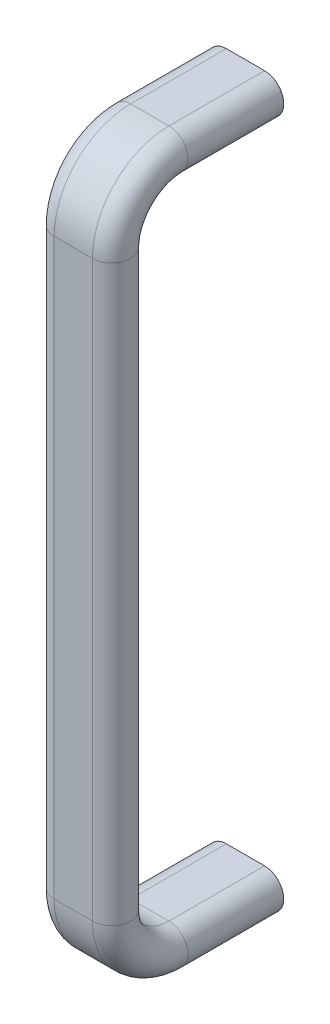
ISO-10303-21;
HEADER;
FILE_DESCRIPTION(('STEP AP214'),'2;1');
FILE_NAME('part.step','',(''),(''),'','','');
FILE_SCHEMA(('AUTOMOTIVE_DESIGN { 1 0 10303 214 1 1 1 1 }'));
ENDSEC;
DATA;
#1=APPLICATION_CONTEXT('core data for automotive mechanical design processes');
#2=APPLICATION_PROTOCOL_DEFINITION('international standard','automotive_design',2000,#1);
#3=PRODUCT_CONTEXT('',#1,'mechanical');
#4=PRODUCT('Part','Part','',(#3));
#5=PRODUCT_RELATED_PRODUCT_CATEGORY('part','',(#4));
#6=PRODUCT_DEFINITION_FORMATION('','',#4);
#7=PRODUCT_DEFINITION_CONTEXT('part definition',#1,'design');
#8=PRODUCT_DEFINITION('design','',#6,#7);
#9=PRODUCT_DEFINITION_SHAPE('','',#8);
#10=(LENGTH_UNIT() NAMED_UNIT(*) SI_UNIT(.MILLI.,.METRE.));
#11=(NAMED_UNIT(*) PLANE_ANGLE_UNIT() SI_UNIT($,.RADIAN.));
#12=(NAMED_UNIT(*) SI_UNIT($,.STERADIAN.) SOLID_ANGLE_UNIT());
#13=UNCERTAINTY_MEASURE_WITH_UNIT(LENGTH_MEASURE(1.E-05),#10,'distance_accuracy_value','');
#14=(GEOMETRIC_REPRESENTATION_CONTEXT(3) GLOBAL_UNCERTAINTY_ASSIGNED_CONTEXT((#13)) GLOBAL_UNIT_ASSIGNED_CONTEXT((#10,
#11,#12)) REPRESENTATION_CONTEXT('',''));
#15=CARTESIAN_POINT('',(0.,0.,0.));
#16=DIRECTION('',(0.,0.,1.));
#17=DIRECTION('',(1.,0.,0.));
#18=AXIS2_PLACEMENT_3D('',#15,#16,#17);
#19=CARTESIAN_POINT('',(213.429589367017,449.678380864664,9.99999999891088));
#20=DIRECTION('',(0.,0.,-1.));
#21=DIRECTION('',(-1.,0.,0.));
#22=AXIS2_PLACEMENT_3D('',#19,#20,#21);
#23=CONICAL_SURFACE('',#22,2.06699999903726,1.02974425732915);
#24=CARTESIAN_POINT('',(213.429589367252,449.678380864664,11.2419789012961));
#25=VERTEX_POINT('',#24);
#26=VERTEX_LOOP('',#25);
#27=FACE_BOUND('',#26,.T.);
#28=CARTESIAN_POINT('',(213.429589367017,449.678380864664,9.99999999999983));
#29=DIRECTION('',(0.,0.,-1.));
#30=DIRECTION('',(-1.,0.,0.));
#31=AXIS2_PLACEMENT_3D('',#28,#29,#30);
#32=CIRCLE('',#31,2.067);
#33=CARTESIAN_POINT('',(211.362589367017,449.678380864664,9.99999999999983));
#34=VERTEX_POINT('',#33);
#35=EDGE_CURVE('E210',#34,#34,#32,.T.);
#36=ORIENTED_EDGE('',*,*,#35,.T.);
#37=EDGE_LOOP('',(#36));
#38=FACE_BOUND('',#37,.T.);
#39=ADVANCED_FACE('F16',(#27,#38),#23,.F.);
#40=CARTESIAN_POINT('',(213.429589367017,269.678380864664,9.99999999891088));
#41=DIRECTION('',(0.,0.,-1.));
#42=DIRECTION('',(-1.,0.,0.));
#43=AXIS2_PLACEMENT_3D('',#40,#41,#42);
#44=CONICAL_SURFACE('',#43,2.06699999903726,1.02974425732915);
#45=CARTESIAN_POINT('',(213.429589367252,269.678380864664,11.2419789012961));
#46=VERTEX_POINT('',#45);
#47=VERTEX_LOOP('',#46);
#48=FACE_BOUND('',#47,.T.);
#49=CARTESIAN_POINT('',(213.429589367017,269.678380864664,9.99999999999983));
#50=DIRECTION('',(0.,0.,-1.));
#51=DIRECTION('',(-1.,0.,0.));
#52=AXIS2_PLACEMENT_3D('',#49,#50,#51);
#53=CIRCLE('',#52,2.067);
#54=CARTESIAN_POINT('',(211.362589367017,269.678380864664,9.99999999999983));
#55=VERTEX_POINT('',#54);
#56=EDGE_CURVE('E131',#55,#55,#53,.T.);
#57=ORIENTED_EDGE('',*,*,#56,.T.);
#58=EDGE_LOOP('',(#57));
#59=FACE_BOUND('',#58,.T.);
#60=ADVANCED_FACE('F398',(#48,#59),#44,.F.);
#61=CARTESIAN_POINT('',(213.429589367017,449.678380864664,2.49999999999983));
#62=DIRECTION('',(0.,0.,-1.));
#63=DIRECTION('',(-1.,0.,0.));
#64=AXIS2_PLACEMENT_3D('',#61,#62,#63);
#65=CYLINDRICAL_SURFACE('',#64,2.067);
#66=ORIENTED_EDGE('',*,*,#35,.F.);
#67=EDGE_LOOP('',(#66));
#68=FACE_BOUND('',#67,.T.);
#69=CARTESIAN_POINT('',(213.429589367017,449.678380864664,-5.00000000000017));
#70=DIRECTION('',(0.,0.,-1.));
#71=DIRECTION('',(-1.,0.,0.));
#72=AXIS2_PLACEMENT_3D('',#69,#70,#71);
#73=CIRCLE('',#72,2.067);
#74=CARTESIAN_POINT('',(211.362589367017,449.678380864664,-5.00000000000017));
#75=VERTEX_POINT('',#74);
#76=EDGE_CURVE('E130',#75,#75,#73,.T.);
#77=ORIENTED_EDGE('',*,*,#76,.T.);
#78=EDGE_LOOP('',(#77));
#79=FACE_BOUND('',#78,.T.);
#80=ADVANCED_FACE('F395',(#68,#79),#65,.F.);
#81=CARTESIAN_POINT('',(213.429589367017,269.678380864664,2.49999999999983));
#82=DIRECTION('',(0.,0.,-1.));
#83=DIRECTION('',(-1.,0.,0.));
#84=AXIS2_PLACEMENT_3D('',#81,#82,#83);
#85=CYLINDRICAL_SURFACE('',#84,2.067);
#86=ORIENTED_EDGE('',*,*,#56,.F.);
#87=EDGE_LOOP('',(#86));
#88=FACE_BOUND('',#87,.T.);
#89=CARTESIAN_POINT('',(213.429589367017,269.678380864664,-5.00000000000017));
#90=DIRECTION('',(0.,0.,-1.));
#91=DIRECTION('',(-1.,0.,0.));
#92=AXIS2_PLACEMENT_3D('',#89,#90,#91);
#93=CIRCLE('',#92,2.067);
#94=CARTESIAN_POINT('',(211.362589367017,269.678380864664,-5.00000000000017));
#95=VERTEX_POINT('',#94);
#96=EDGE_CURVE('E150',#95,#95,#93,.T.);
#97=ORIENTED_EDGE('',*,*,#96,.T.);
#98=EDGE_LOOP('',(#97));
#99=FACE_BOUND('',#98,.T.);
#100=ADVANCED_FACE('F392',(#88,#99),#85,.F.);
#101=CARTESIAN_POINT('',(213.429589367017,454.678380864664,7.49999999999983));
#102=DIRECTION('',(0.,1.,0.));
#103=DIRECTION('',(0.,0.,1.));
#104=AXIS2_PLACEMENT_3D('',#101,#102,#103);
#105=PLANE('',#104);
#106=DIRECTION('',(1.,0.,0.));
#107=VECTOR('',#106,1.);
#108=CARTESIAN_POINT('',(213.429589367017,454.678380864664,-5.00000000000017));
#109=LINE('',#108,#107);
#110=CARTESIAN_POINT('',(218.429589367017,454.678380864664,-5.00000000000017));
#111=VERTEX_POINT('',#110);
#112=CARTESIAN_POINT('',(208.429589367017,454.678380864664,-5.00000000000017));
#113=VERTEX_POINT('',#112);
#114=EDGE_CURVE('E120',#111,#113,#109,.F.);
#115=ORIENTED_EDGE('',*,*,#114,.T.);
#116=DIRECTION('',(0.,0.,-1.));
#117=VECTOR('',#116,1.);
#118=CARTESIAN_POINT('',(208.429589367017,454.678380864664,-1.708932E-13));
#119=LINE('',#118,#117);
#120=CARTESIAN_POINT('',(208.429589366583,454.678380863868,19.9999999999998));
#121=VERTEX_POINT('',#120);
#122=EDGE_CURVE('E229',#121,#113,#119,.T.);
#123=ORIENTED_EDGE('',*,*,#122,.F.);
#124=DIRECTION('',(1.,0.,0.));
#125=VECTOR('',#124,1.);
#126=CARTESIAN_POINT('',(216.429589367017,454.678380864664,19.9999999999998));
#127=LINE('',#126,#125);
#128=CARTESIAN_POINT('',(218.429589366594,454.678380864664,19.9999999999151));
#129=VERTEX_POINT('',#128);
#130=EDGE_CURVE('E137',#129,#121,#127,.F.);
#131=ORIENTED_EDGE('',*,*,#130,.F.);
#132=DIRECTION('',(0.,0.,-1.));
#133=VECTOR('',#132,1.);
#134=CARTESIAN_POINT('',(218.429589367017,454.678380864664,-1.708932E-13));
#135=LINE('',#134,#133);
#136=EDGE_CURVE('E134',#111,#129,#135,.F.);
#137=ORIENTED_EDGE('',*,*,#136,.F.);
#138=EDGE_LOOP('',(#115,#123,#131,#137));
#139=FACE_BOUND('',#138,.T.);
#140=ADVANCED_FACE('F135',(#139),#105,.T.);
#141=CARTESIAN_POINT('',(218.429589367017,264.678380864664,0.));
#142=DIRECTION('',(0.,-1.,0.));
#143=DIRECTION('',(0.,0.,-1.));
#144=AXIS2_PLACEMENT_3D('',#141,#142,#143);
#145=PLANE('',#144);
#146=DIRECTION('',(1.,0.,0.));
#147=VECTOR('',#146,1.);
#148=CARTESIAN_POINT('',(213.429589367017,264.678380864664,-5.));
#149=LINE('',#148,#147);
#150=CARTESIAN_POINT('',(208.429589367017,264.678380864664,-5.));
#151=VERTEX_POINT('',#150);
#152=CARTESIAN_POINT('',(218.429589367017,264.678380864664,-5.));
#153=VERTEX_POINT('',#152);
#154=EDGE_CURVE('E140',#151,#153,#149,.T.);
#155=ORIENTED_EDGE('',*,*,#154,.T.);
#156=DIRECTION('',(0.,0.,1.));
#157=VECTOR('',#156,1.);
#158=CARTESIAN_POINT('',(218.429589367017,264.678380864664,0.));
#159=LINE('',#158,#157);
#160=CARTESIAN_POINT('',(218.429589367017,264.678380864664,20.));
#161=VERTEX_POINT('',#160);
#162=EDGE_CURVE('E196',#161,#153,#159,.F.);
#163=ORIENTED_EDGE('',*,*,#162,.F.);
#164=DIRECTION('',(-1.,0.,0.));
#165=VECTOR('',#164,1.);
#166=CARTESIAN_POINT('',(213.429589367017,264.678380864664,20.));
#167=LINE('',#166,#165);
#168=CARTESIAN_POINT('',(208.429589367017,264.678380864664,20.));
#169=VERTEX_POINT('',#168);
#170=EDGE_CURVE('E202',#169,#161,#167,.F.);
#171=ORIENTED_EDGE('',*,*,#170,.F.);
#172=DIRECTION('',(0.,0.,1.));
#173=VECTOR('',#172,1.);
#174=CARTESIAN_POINT('',(208.429589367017,264.678380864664,0.));
#175=LINE('',#174,#173);
#176=EDGE_CURVE('E184',#151,#169,#175,.T.);
#177=ORIENTED_EDGE('',*,*,#176,.F.);
#178=EDGE_LOOP('',(#155,#163,#171,#177));
#179=FACE_BOUND('',#178,.T.);
#180=ADVANCED_FACE('F385',(#179),#145,.T.);
#181=CARTESIAN_POINT('',(213.429589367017,449.678380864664,-5.00000000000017));
#182=DIRECTION('',(0.,0.,1.));
#183=DIRECTION('',(1.,0.,0.));
#184=AXIS2_PLACEMENT_3D('',#181,#182,#183);
#185=PLANE('',#184);
#186=ORIENTED_EDGE('',*,*,#76,.F.);
#187=EDGE_LOOP('',(#186));
#188=FACE_BOUND('',#187,.T.);
#189=ORIENTED_EDGE('',*,*,#114,.F.);
#190=CARTESIAN_POINT('',(218.429589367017,449.678380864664,-5.00000000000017));
#191=DIRECTION('',(0.,0.,-1.));
#192=DIRECTION('',(-1.,0.,0.));
#193=AXIS2_PLACEMENT_3D('',#190,#191,#192);
#194=CIRCLE('',#193,5.00000000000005);
#195=CARTESIAN_POINT('',(218.429589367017,444.678380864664,-5.00000000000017));
#196=VERTEX_POINT('',#195);
#197=EDGE_CURVE('E125',#196,#111,#194,.F.);
#198=ORIENTED_EDGE('',*,*,#197,.F.);
#199=DIRECTION('',(1.,0.,0.));
#200=VECTOR('',#199,1.);
#201=CARTESIAN_POINT('',(213.429589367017,444.678380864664,-5.00000000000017));
#202=LINE('',#201,#200);
#203=CARTESIAN_POINT('',(208.429589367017,444.678380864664,-5.00000000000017));
#204=VERTEX_POINT('',#203);
#205=EDGE_CURVE('E301',#204,#196,#202,.T.);
#206=ORIENTED_EDGE('',*,*,#205,.F.);
#207=CARTESIAN_POINT('',(208.429589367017,449.678380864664,-5.00000000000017));
#208=DIRECTION('',(0.,0.,-1.));
#209=DIRECTION('',(-1.,0.,0.));
#210=AXIS2_PLACEMENT_3D('',#207,#208,#209);
#211=CIRCLE('',#210,5.00000000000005);
#212=EDGE_CURVE('E127',#113,#204,#211,.F.);
#213=ORIENTED_EDGE('',*,*,#212,.F.);
#214=EDGE_LOOP('',(#189,#198,#206,#213));
#215=FACE_BOUND('',#214,.T.);
#216=ADVANCED_FACE('F122',(#188,#215),#185,.F.);
#217=CARTESIAN_POINT('',(218.429589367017,449.678380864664,-1.708932E-13));
#218=DIRECTION('',(0.,0.,-1.));
#219=DIRECTION('',(-1.,0.,0.));
#220=AXIS2_PLACEMENT_3D('',#217,#218,#219);
#221=CYLINDRICAL_SURFACE('',#220,5.00000000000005);
#222=ORIENTED_EDGE('',*,*,#136,.T.);
#223=CARTESIAN_POINT('',(218.429589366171,449.678380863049,20.0000000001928));
#224=DIRECTION('',(3.85946799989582E-11,7.25028370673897E-11,1.));
#225=DIRECTION('',(-1.4371589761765E-11,1.,-7.25041693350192E-11));
#226=AXIS2_PLACEMENT_3D('',#223,#224,#225);
#227=CIRCLE('',#226,5.00000000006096);
#228=CARTESIAN_POINT('',(223.429589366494,449.678380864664,19.9999999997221));
#229=VERTEX_POINT('',#228);
#230=EDGE_CURVE('E226',#229,#129,#227,.T.);
#231=ORIENTED_EDGE('',*,*,#230,.F.);
#232=CARTESIAN_POINT('',(218.429589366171,449.678380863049,19.9999999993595));
#233=DIRECTION('',(3.85946799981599E-11,1.28051791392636E-10,1.));
#234=DIRECTION('',(-1.43715897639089E-11,1.,-1.28053068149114E-10));
#235=AXIS2_PLACEMENT_3D('',#232,#233,#234);
#236=CIRCLE('',#235,5.00000000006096);
#237=CARTESIAN_POINT('',(218.429589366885,444.678380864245,19.9999999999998));
#238=VERTEX_POINT('',#237);
#239=EDGE_CURVE('E287',#238,#229,#236,.T.);
#240=ORIENTED_EDGE('',*,*,#239,.F.);
#241=DIRECTION('',(0.,0.,-1.));
#242=VECTOR('',#241,1.);
#243=CARTESIAN_POINT('',(218.429589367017,444.678380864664,7.49999999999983));
#244=LINE('',#243,#242);
#245=EDGE_CURVE('E144',#196,#238,#244,.F.);
#246=ORIENTED_EDGE('',*,*,#245,.F.);
#247=ORIENTED_EDGE('',*,*,#197,.T.);
#248=EDGE_LOOP('',(#222,#231,#240,#246,#247));
#249=FACE_BOUND('',#248,.T.);
#250=ADVANCED_FACE('F142',(#249),#221,.T.);
#251=CARTESIAN_POINT('',(213.429589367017,269.678380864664,-5.));
#252=DIRECTION('',(0.,0.,1.));
#253=DIRECTION('',(1.,0.,0.));
#254=AXIS2_PLACEMENT_3D('',#251,#252,#253);
#255=PLANE('',#254);
#256=ORIENTED_EDGE('',*,*,#96,.F.);
#257=EDGE_LOOP('',(#256));
#258=FACE_BOUND('',#257,.T.);
#259=DIRECTION('',(1.,0.,0.));
#260=VECTOR('',#259,1.);
#261=CARTESIAN_POINT('',(208.429589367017,274.678380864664,-5.));
#262=LINE('',#261,#260);
#263=CARTESIAN_POINT('',(218.429589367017,274.678380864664,-5.));
#264=VERTEX_POINT('',#263);
#265=CARTESIAN_POINT('',(208.429589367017,274.678380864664,-5.));
#266=VERTEX_POINT('',#265);
#267=EDGE_CURVE('E264',#264,#266,#262,.F.);
#268=ORIENTED_EDGE('',*,*,#267,.F.);
#269=CARTESIAN_POINT('',(218.429589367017,269.678380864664,-5.));
#270=DIRECTION('',(0.,0.,1.));
#271=DIRECTION('',(1.,0.,0.));
#272=AXIS2_PLACEMENT_3D('',#269,#270,#271);
#273=CIRCLE('',#272,5.);
#274=EDGE_CURVE('E199',#153,#264,#273,.T.);
#275=ORIENTED_EDGE('',*,*,#274,.F.);
#276=ORIENTED_EDGE('',*,*,#154,.F.);
#277=CARTESIAN_POINT('',(208.429589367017,269.678380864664,-5.));
#278=DIRECTION('',(0.,0.,1.));
#279=DIRECTION('',(1.,0.,0.));
#280=AXIS2_PLACEMENT_3D('',#277,#278,#279);
#281=CIRCLE('',#280,5.);
#282=EDGE_CURVE('E188',#266,#151,#281,.T.);
#283=ORIENTED_EDGE('',*,*,#282,.F.);
#284=EDGE_LOOP('',(#268,#275,#276,#283));
#285=FACE_BOUND('',#284,.T.);
#286=ADVANCED_FACE('F377',(#258,#285),#255,.F.);
#287=CARTESIAN_POINT('',(218.429589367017,269.678380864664,0.));
#288=DIRECTION('',(0.,0.,1.));
#289=DIRECTION('',(1.,0.,0.));
#290=AXIS2_PLACEMENT_3D('',#287,#288,#289);
#291=CYLINDRICAL_SURFACE('',#290,5.);
#292=DIRECTION('',(0.,0.,1.));
#293=VECTOR('',#292,1.);
#294=CARTESIAN_POINT('',(218.429589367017,274.678380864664,0.));
#295=LINE('',#294,#293);
#296=CARTESIAN_POINT('',(218.429589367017,274.678380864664,20.));
#297=VERTEX_POINT('',#296);
#298=EDGE_CURVE('E261',#297,#264,#295,.F.);
#299=ORIENTED_EDGE('',*,*,#298,.F.);
#300=CARTESIAN_POINT('',(218.429589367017,269.678380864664,20.));
#301=DIRECTION('',(0.,0.,1.));
#302=DIRECTION('',(0.,-1.,0.));
#303=AXIS2_PLACEMENT_3D('',#300,#301,#302);
#304=CIRCLE('',#303,5.);
#305=EDGE_CURVE('E244',#161,#297,#304,.T.);
#306=ORIENTED_EDGE('',*,*,#305,.F.);
#307=ORIENTED_EDGE('',*,*,#162,.T.);
#308=ORIENTED_EDGE('',*,*,#274,.T.);
#309=EDGE_LOOP('',(#299,#306,#307,#308));
#310=FACE_BOUND('',#309,.T.);
#311=ADVANCED_FACE('F373',(#310),#291,.T.);
#312=CARTESIAN_POINT('',(218.429589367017,284.678380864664,40.0000000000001));
#313=DIRECTION('',(0.,0.,1.));
#314=DIRECTION('',(1.,0.,0.));
#315=AXIS2_PLACEMENT_3D('',#312,#313,#314);
#316=PLANE('',#315);
#317=DIRECTION('',(-1.,0.,0.));
#318=VECTOR('',#317,1.);
#319=CARTESIAN_POINT('',(213.429589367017,284.678380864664,40.));
#320=LINE('',#319,#318);
#321=CARTESIAN_POINT('',(218.429589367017,284.678380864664,40.));
#322=VERTEX_POINT('',#321);
#323=CARTESIAN_POINT('',(208.429589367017,284.678380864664,40.));
#324=VERTEX_POINT('',#323);
#325=EDGE_CURVE('E187',#322,#324,#320,.T.);
#326=ORIENTED_EDGE('',*,*,#325,.F.);
#327=DIRECTION('',(0.,1.,0.));
#328=VECTOR('',#327,1.);
#329=CARTESIAN_POINT('',(218.429589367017,284.678380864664,40.0000000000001));
#330=LINE('',#329,#328);
#331=CARTESIAN_POINT('',(218.429589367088,434.678380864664,40.0000000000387));
#332=VERTEX_POINT('',#331);
#333=EDGE_CURVE('E285',#332,#322,#330,.F.);
#334=ORIENTED_EDGE('',*,*,#333,.F.);
#335=DIRECTION('',(1.,0.,0.));
#336=VECTOR('',#335,1.);
#337=CARTESIAN_POINT('',(216.429589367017,434.678380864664,39.9999999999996));
#338=LINE('',#337,#336);
#339=CARTESIAN_POINT('',(208.429589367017,434.678380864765,40.0000000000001));
#340=VERTEX_POINT('',#339);
#341=EDGE_CURVE('E230',#340,#332,#338,.T.);
#342=ORIENTED_EDGE('',*,*,#341,.F.);
#343=DIRECTION('',(0.,1.,0.));
#344=VECTOR('',#343,1.);
#345=CARTESIAN_POINT('',(208.429589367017,284.678380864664,40.0000000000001));
#346=LINE('',#345,#344);
#347=EDGE_CURVE('E241',#324,#340,#346,.T.);
#348=ORIENTED_EDGE('',*,*,#347,.F.);
#349=EDGE_LOOP('',(#326,#334,#342,#348));
#350=FACE_BOUND('',#349,.T.);
#351=ADVANCED_FACE('F370',(#350),#316,.T.);
#352=CARTESIAN_POINT('',(216.429589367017,434.678380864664,19.9999999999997));
#353=DIRECTION('',(1.,0.,0.));
#354=DIRECTION('',(0.,0.,-1.));
#355=AXIS2_PLACEMENT_3D('',#352,#353,#354);
#356=CYLINDRICAL_SURFACE('',#355,19.9999999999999);
#357=ORIENTED_EDGE('',*,*,#130,.T.);
#358=CARTESIAN_POINT('',(208.429589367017,434.678380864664,19.9999999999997));
#359=DIRECTION('',(1.,0.,0.));
#360=DIRECTION('',(0.,0.,-1.));
#361=AXIS2_PLACEMENT_3D('',#358,#359,#360);
#362=CIRCLE('',#361,19.9999999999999);
#363=EDGE_CURVE('E217',#340,#121,#362,.F.);
#364=ORIENTED_EDGE('',*,*,#363,.F.);
#365=ORIENTED_EDGE('',*,*,#341,.T.);
#366=CARTESIAN_POINT('',(218.429589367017,434.678380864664,19.9999999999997));
#367=DIRECTION('',(1.,0.,0.));
#368=DIRECTION('',(0.,0.,-1.));
#369=AXIS2_PLACEMENT_3D('',#366,#367,#368);
#370=CIRCLE('',#369,19.9999999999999);
#371=EDGE_CURVE('E222',#129,#332,#370,.T.);
#372=ORIENTED_EDGE('',*,*,#371,.F.);
#373=EDGE_LOOP('',(#357,#364,#365,#372));
#374=FACE_BOUND('',#373,.T.);
#375=ADVANCED_FACE('F367',(#374),#356,.T.);
#376=CARTESIAN_POINT('',(208.429589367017,449.678380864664,-1.708932E-13));
#377=DIRECTION('',(0.,0.,-1.));
#378=DIRECTION('',(-1.,0.,0.));
#379=AXIS2_PLACEMENT_3D('',#376,#377,#378);
#380=CYLINDRICAL_SURFACE('',#379,5.00000000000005);
#381=DIRECTION('',(0.,0.,-1.));
#382=VECTOR('',#381,1.);
#383=CARTESIAN_POINT('',(208.429589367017,444.678380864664,7.49999999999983));
#384=LINE('',#383,#382);
#385=CARTESIAN_POINT('',(208.429589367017,444.678380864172,20.0000000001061));
#386=VERTEX_POINT('',#385);
#387=EDGE_CURVE('E205',#386,#204,#384,.T.);
#388=ORIENTED_EDGE('',*,*,#387,.F.);
#389=CARTESIAN_POINT('',(208.429589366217,449.67838086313,19.9999999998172));
#390=DIRECTION('',(3.65029199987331E-11,9.32201538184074E-11,1.));
#391=DIRECTION('',(-1.35908037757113E-11,1.,-9.32240951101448E-11));
#392=AXIS2_PLACEMENT_3D('',#389,#390,#391);
#393=CIRCLE('',#392,4.99999999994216);
#394=CARTESIAN_POINT('',(203.429589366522,449.678380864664,19.9999999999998));
#395=VERTEX_POINT('',#394);
#396=EDGE_CURVE('E193',#395,#386,#393,.T.);
#397=ORIENTED_EDGE('',*,*,#396,.F.);
#398=CARTESIAN_POINT('',(208.429589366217,449.67838086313,20.0000000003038));
#399=DIRECTION('',(3.65029199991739E-11,6.07876526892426E-11,1.));
#400=DIRECTION('',(-1.35908037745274E-11,1.,-6.079159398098E-11));
#401=AXIS2_PLACEMENT_3D('',#398,#399,#400);
#402=CIRCLE('',#401,4.99999999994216);
#403=EDGE_CURVE('E220',#121,#395,#402,.T.);
#404=ORIENTED_EDGE('',*,*,#403,.F.);
#405=ORIENTED_EDGE('',*,*,#122,.T.);
#406=ORIENTED_EDGE('',*,*,#212,.T.);
#407=EDGE_LOOP('',(#388,#397,#404,#405,#406));
#408=FACE_BOUND('',#407,.T.);
#409=ADVANCED_FACE('F315',(#408),#380,.T.);
#410=CARTESIAN_POINT('',(208.429589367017,269.678380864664,0.));
#411=DIRECTION('',(0.,0.,1.));
#412=DIRECTION('',(1.,0.,0.));
#413=AXIS2_PLACEMENT_3D('',#410,#411,#412);
#414=CYLINDRICAL_SURFACE('',#413,5.);
#415=ORIENTED_EDGE('',*,*,#176,.T.);
#416=CARTESIAN_POINT('',(208.429589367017,269.678380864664,20.));
#417=DIRECTION('',(0.,0.,1.));
#418=DIRECTION('',(0.,-1.,0.));
#419=AXIS2_PLACEMENT_3D('',#416,#417,#418);
#420=CIRCLE('',#419,5.);
#421=CARTESIAN_POINT('',(208.429589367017,274.678380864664,20.));
#422=VERTEX_POINT('',#421);
#423=EDGE_CURVE('E189',#422,#169,#420,.T.);
#424=ORIENTED_EDGE('',*,*,#423,.F.);
#425=DIRECTION('',(0.,0.,1.));
#426=VECTOR('',#425,1.);
#427=CARTESIAN_POINT('',(208.429589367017,274.678380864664,0.));
#428=LINE('',#427,#426);
#429=EDGE_CURVE('E269',#266,#422,#428,.T.);
#430=ORIENTED_EDGE('',*,*,#429,.F.);
#431=ORIENTED_EDGE('',*,*,#282,.T.);
#432=EDGE_LOOP('',(#415,#424,#430,#431));
#433=FACE_BOUND('',#432,.T.);
#434=ADVANCED_FACE('F360',(#433),#414,.T.);
#435=CARTESIAN_POINT('',(213.429589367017,284.678380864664,20.));
#436=DIRECTION('',(-1.,0.,0.));
#437=DIRECTION('',(0.,0.,1.));
#438=AXIS2_PLACEMENT_3D('',#435,#436,#437);
#439=CYLINDRICAL_SURFACE('',#438,20.);
#440=ORIENTED_EDGE('',*,*,#170,.T.);
#441=CARTESIAN_POINT('',(218.429589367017,284.678380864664,20.));
#442=DIRECTION('',(-1.,0.,0.));
#443=DIRECTION('',(0.,0.,1.));
#444=AXIS2_PLACEMENT_3D('',#441,#442,#443);
#445=CIRCLE('',#444,20.);
#446=EDGE_CURVE('E272',#322,#161,#445,.F.);
#447=ORIENTED_EDGE('',*,*,#446,.F.);
#448=ORIENTED_EDGE('',*,*,#325,.T.);
#449=CARTESIAN_POINT('',(208.429589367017,284.678380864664,20.));
#450=DIRECTION('',(-1.,0.,0.));
#451=DIRECTION('',(0.,0.,1.));
#452=AXIS2_PLACEMENT_3D('',#449,#450,#451);
#453=CIRCLE('',#452,20.);
#454=EDGE_CURVE('E192',#169,#324,#453,.T.);
#455=ORIENTED_EDGE('',*,*,#454,.F.);
#456=EDGE_LOOP('',(#440,#447,#448,#455));
#457=FACE_BOUND('',#456,.T.);
#458=ADVANCED_FACE('F357',(#457),#439,.T.);
#459=CARTESIAN_POINT('',(213.429589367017,444.678380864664,7.49999999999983));
#460=DIRECTION('',(0.,-1.,0.));
#461=DIRECTION('',(0.,0.,-1.));
#462=AXIS2_PLACEMENT_3D('',#459,#460,#461);
#463=PLANE('',#462);
#464=ORIENTED_EDGE('',*,*,#205,.T.);
#465=ORIENTED_EDGE('',*,*,#245,.T.);
#466=DIRECTION('',(1.,0.,0.));
#467=VECTOR('',#466,1.);
#468=CARTESIAN_POINT('',(210.429589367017,444.678380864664,19.9999999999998));
#469=LINE('',#468,#467);
#470=EDGE_CURVE('E168',#238,#386,#469,.F.);
#471=ORIENTED_EDGE('',*,*,#470,.T.);
#472=ORIENTED_EDGE('',*,*,#387,.T.);
#473=EDGE_LOOP('',(#464,#465,#471,#472));
#474=FACE_BOUND('',#473,.T.);
#475=ADVANCED_FACE('F312',(#474),#463,.T.);
#476=CARTESIAN_POINT('',(218.429589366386,434.678380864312,20.0000000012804));
#477=DIRECTION('',(1.,1.436966E-11,-3.859468E-11));
#478=DIRECTION('',(-3.74514439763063E-11,0.707106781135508,-0.707106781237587));
#479=AXIS2_PLACEMENT_3D('',#476,#477,#478);
#480=TOROIDAL_SURFACE('',#479,14.9999999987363,5.00000000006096);
#481=ORIENTED_EDGE('',*,*,#371,.T.);
#482=CARTESIAN_POINT('',(218.429589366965,434.678380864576,35.0000000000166));
#483=DIRECTION('',(1.43696600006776E-11,-1.,1.75569558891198E-11));
#484=DIRECTION('',(3.8592750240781E-11,1.75582326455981E-11,1.));
#485=AXIS2_PLACEMENT_3D('',#482,#483,#484);
#486=CIRCLE('',#485,5.00000000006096);
#487=CARTESIAN_POINT('',(223.429589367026,434.678380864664,35.));
#488=VERTEX_POINT('',#487);
#489=EDGE_CURVE('E225',#332,#488,#486,.F.);
#490=ORIENTED_EDGE('',*,*,#489,.T.);
#491=CARTESIAN_POINT('',(218.429589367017,434.678380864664,35.0000000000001));
#492=DIRECTION('',(0.,1.,0.));
#493=DIRECTION('',(0.,0.,1.));
#494=AXIS2_PLACEMENT_3D('',#491,#492,#493);
#495=CIRCLE('',#494,5.);
#496=CARTESIAN_POINT('',(218.429589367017,434.678380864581,29.9999999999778));
#497=VERTEX_POINT('',#496);
#498=EDGE_CURVE('E159',#497,#488,#495,.F.);
#499=ORIENTED_EDGE('',*,*,#498,.F.);
#500=CARTESIAN_POINT('',(218.429589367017,434.678380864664,19.9999999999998));
#501=DIRECTION('',(1.,0.,0.));
#502=DIRECTION('',(0.,0.,-1.));
#503=AXIS2_PLACEMENT_3D('',#500,#501,#502);
#504=CIRCLE('',#503,10.);
#505=EDGE_CURVE('E176',#497,#238,#504,.F.);
#506=ORIENTED_EDGE('',*,*,#505,.T.);
#507=ORIENTED_EDGE('',*,*,#239,.T.);
#508=ORIENTED_EDGE('',*,*,#230,.T.);
#509=EDGE_LOOP('',(#481,#490,#499,#506,#507,#508));
#510=FACE_BOUND('',#509,.T.);
#511=ADVANCED_FACE('F350',(#510),#480,.T.);
#512=CARTESIAN_POINT('',(208.429589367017,274.678380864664,0.));
#513=DIRECTION('',(0.,1.,0.));
#514=DIRECTION('',(0.,0.,1.));
#515=AXIS2_PLACEMENT_3D('',#512,#513,#514);
#516=PLANE('',#515);
#517=ORIENTED_EDGE('',*,*,#267,.T.);
#518=ORIENTED_EDGE('',*,*,#429,.T.);
#519=DIRECTION('',(-1.,0.,0.));
#520=VECTOR('',#519,1.);
#521=CARTESIAN_POINT('',(213.429589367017,274.678380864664,20.));
#522=LINE('',#521,#520);
#523=EDGE_CURVE('E273',#422,#297,#522,.F.);
#524=ORIENTED_EDGE('',*,*,#523,.T.);
#525=ORIENTED_EDGE('',*,*,#298,.T.);
#526=EDGE_LOOP('',(#517,#518,#524,#525));
#527=FACE_BOUND('',#526,.T.);
#528=ADVANCED_FACE('F345',(#527),#516,.T.);
#529=CARTESIAN_POINT('',(218.429589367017,284.678380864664,20.));
#530=DIRECTION('',(-1.,0.,0.));
#531=DIRECTION('',(0.,0.,1.));
#532=AXIS2_PLACEMENT_3D('',#529,#530,#531);
#533=TOROIDAL_SURFACE('',#532,15.,5.);
#534=ORIENTED_EDGE('',*,*,#305,.T.);
#535=CARTESIAN_POINT('',(218.429589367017,284.678380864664,20.));
#536=DIRECTION('',(-1.,0.,0.));
#537=DIRECTION('',(0.,0.,1.));
#538=AXIS2_PLACEMENT_3D('',#535,#536,#537);
#539=CIRCLE('',#538,10.);
#540=CARTESIAN_POINT('',(218.429589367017,284.678380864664,30.));
#541=VERTEX_POINT('',#540);
#542=EDGE_CURVE('E249',#297,#541,#539,.T.);
#543=ORIENTED_EDGE('',*,*,#542,.T.);
#544=CARTESIAN_POINT('',(218.429589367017,284.678380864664,35.0000000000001));
#545=DIRECTION('',(0.,1.,0.));
#546=DIRECTION('',(0.,0.,1.));
#547=AXIS2_PLACEMENT_3D('',#544,#545,#546);
#548=CIRCLE('',#547,5.);
#549=EDGE_CURVE('E157',#322,#541,#548,.T.);
#550=ORIENTED_EDGE('',*,*,#549,.F.);
#551=ORIENTED_EDGE('',*,*,#446,.T.);
#552=EDGE_LOOP('',(#534,#543,#550,#551));
#553=FACE_BOUND('',#552,.T.);
#554=ADVANCED_FACE('F340',(#553),#533,.T.);
#555=CARTESIAN_POINT('',(208.42958936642,434.67838086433,20.0000000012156));
#556=DIRECTION('',(1.,1.359062E-11,-3.650292E-11));
#557=DIRECTION('',(-3.54214818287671E-11,0.707106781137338,-0.707106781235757));
#558=AXIS2_PLACEMENT_3D('',#555,#556,#557);
#559=TOROIDAL_SURFACE('',#558,14.9999999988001,4.99999999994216);
#560=CARTESIAN_POINT('',(208.429589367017,434.678380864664,19.9999999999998));
#561=DIRECTION('',(1.,0.,0.));
#562=DIRECTION('',(0.,0.,-1.));
#563=AXIS2_PLACEMENT_3D('',#560,#561,#562);
#564=CIRCLE('',#563,10.);
#565=CARTESIAN_POINT('',(208.429589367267,434.678380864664,30.0000000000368));
#566=VERTEX_POINT('',#565);
#567=EDGE_CURVE('E160',#386,#566,#564,.T.);
#568=ORIENTED_EDGE('',*,*,#567,.T.);
#569=CARTESIAN_POINT('',(208.429589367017,434.678380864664,35.0000000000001));
#570=DIRECTION('',(0.,1.,0.));
#571=DIRECTION('',(0.,0.,1.));
#572=AXIS2_PLACEMENT_3D('',#569,#570,#571);
#573=CIRCLE('',#572,5.);
#574=CARTESIAN_POINT('',(203.429589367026,434.678380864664,35.));
#575=VERTEX_POINT('',#574);
#576=EDGE_CURVE('E155',#575,#566,#573,.F.);
#577=ORIENTED_EDGE('',*,*,#576,.F.);
#578=CARTESIAN_POINT('',(208.429589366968,434.678380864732,35.0000000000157));
#579=DIRECTION('',(1.35906200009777E-11,-1.,2.67845745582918E-11));
#580=DIRECTION('',(3.65027362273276E-11,2.67884048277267E-11,1.));
#581=AXIS2_PLACEMENT_3D('',#578,#579,#580);
#582=CIRCLE('',#581,4.99999999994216);
#583=EDGE_CURVE('E221',#575,#340,#582,.F.);
#584=ORIENTED_EDGE('',*,*,#583,.T.);
#585=ORIENTED_EDGE('',*,*,#363,.T.);
#586=ORIENTED_EDGE('',*,*,#403,.T.);
#587=ORIENTED_EDGE('',*,*,#396,.T.);
#588=EDGE_LOOP('',(#568,#577,#584,#585,#586,#587));
#589=FACE_BOUND('',#588,.T.);
#590=ADVANCED_FACE('F344',(#589),#559,.T.);
#591=CARTESIAN_POINT('',(208.429589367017,284.678380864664,20.));
#592=DIRECTION('',(-1.,0.,0.));
#593=DIRECTION('',(0.,0.,1.));
#594=AXIS2_PLACEMENT_3D('',#591,#592,#593);
#595=TOROIDAL_SURFACE('',#594,15.,5.);
#596=ORIENTED_EDGE('',*,*,#423,.T.);
#597=ORIENTED_EDGE('',*,*,#454,.T.);
#598=CARTESIAN_POINT('',(208.429589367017,284.678380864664,35.0000000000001));
#599=DIRECTION('',(0.,1.,0.));
#600=DIRECTION('',(0.,0.,1.));
#601=AXIS2_PLACEMENT_3D('',#598,#599,#600);
#602=CIRCLE('',#601,5.);
#603=CARTESIAN_POINT('',(208.429589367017,284.678380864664,30.));
#604=VERTEX_POINT('',#603);
#605=EDGE_CURVE('E34',#604,#324,#602,.T.);
#606=ORIENTED_EDGE('',*,*,#605,.F.);
#607=CARTESIAN_POINT('',(208.429589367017,284.678380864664,20.));
#608=DIRECTION('',(-1.,0.,0.));
#609=DIRECTION('',(0.,0.,1.));
#610=AXIS2_PLACEMENT_3D('',#607,#608,#609);
#611=CIRCLE('',#610,10.);
#612=EDGE_CURVE('E166',#604,#422,#611,.F.);
#613=ORIENTED_EDGE('',*,*,#612,.T.);
#614=EDGE_LOOP('',(#596,#597,#606,#613));
#615=FACE_BOUND('',#614,.T.);
#616=ADVANCED_FACE('F429',(#615),#595,.T.);
#617=CARTESIAN_POINT('',(210.429589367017,434.678380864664,19.9999999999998));
#618=DIRECTION('',(1.,0.,0.));
#619=DIRECTION('',(0.,0.,-1.));
#620=AXIS2_PLACEMENT_3D('',#617,#618,#619);
#621=CYLINDRICAL_SURFACE('',#620,10.);
#622=ORIENTED_EDGE('',*,*,#567,.F.);
#623=ORIENTED_EDGE('',*,*,#470,.F.);
#624=ORIENTED_EDGE('',*,*,#505,.F.);
#625=DIRECTION('',(-1.,0.,0.));
#626=VECTOR('',#625,1.);
#627=CARTESIAN_POINT('',(208.429589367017,434.678380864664,30.0000000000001));
#628=LINE('',#627,#626);
#629=EDGE_CURVE('E154',#566,#497,#628,.F.);
#630=ORIENTED_EDGE('',*,*,#629,.F.);
#631=EDGE_LOOP('',(#622,#623,#624,#630));
#632=FACE_BOUND('',#631,.T.);
#633=ADVANCED_FACE('F427',(#632),#621,.F.);
#634=CARTESIAN_POINT('',(218.429589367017,284.678380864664,35.0000000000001));
#635=DIRECTION('',(0.,1.,0.));
#636=DIRECTION('',(0.,0.,1.));
#637=AXIS2_PLACEMENT_3D('',#634,#635,#636);
#638=CYLINDRICAL_SURFACE('',#637,5.);
#639=DIRECTION('',(0.,1.,0.));
#640=VECTOR('',#639,1.);
#641=CARTESIAN_POINT('',(218.429589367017,284.678380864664,30.0000000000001));
#642=LINE('',#641,#640);
#643=EDGE_CURVE('E437',#497,#541,#642,.F.);
#644=ORIENTED_EDGE('',*,*,#643,.F.);
#645=ORIENTED_EDGE('',*,*,#498,.T.);
#646=ORIENTED_EDGE('',*,*,#489,.F.);
#647=ORIENTED_EDGE('',*,*,#333,.T.);
#648=ORIENTED_EDGE('',*,*,#549,.T.);
#649=EDGE_LOOP('',(#644,#645,#646,#647,#648));
#650=FACE_BOUND('',#649,.T.);
#651=ADVANCED_FACE('F423',(#650),#638,.T.);
#652=CARTESIAN_POINT('',(213.429589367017,284.678380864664,20.));
#653=DIRECTION('',(-1.,0.,0.));
#654=DIRECTION('',(0.,0.,1.));
#655=AXIS2_PLACEMENT_3D('',#652,#653,#654);
#656=CYLINDRICAL_SURFACE('',#655,10.);
#657=ORIENTED_EDGE('',*,*,#542,.F.);
#658=ORIENTED_EDGE('',*,*,#523,.F.);
#659=ORIENTED_EDGE('',*,*,#612,.F.);
#660=DIRECTION('',(-1.,0.,0.));
#661=VECTOR('',#660,1.);
#662=CARTESIAN_POINT('',(208.429589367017,284.678380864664,30.0000000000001));
#663=LINE('',#662,#661);
#664=EDGE_CURVE('E25',#541,#604,#663,.T.);
#665=ORIENTED_EDGE('',*,*,#664,.F.);
#666=EDGE_LOOP('',(#657,#658,#659,#665));
#667=FACE_BOUND('',#666,.T.);
#668=ADVANCED_FACE('F416',(#667),#656,.F.);
#669=CARTESIAN_POINT('',(208.429589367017,284.678380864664,35.0000000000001));
#670=DIRECTION('',(0.,1.,0.));
#671=DIRECTION('',(0.,0.,1.));
#672=AXIS2_PLACEMENT_3D('',#669,#670,#671);
#673=CYLINDRICAL_SURFACE('',#672,5.);
#674=DIRECTION('',(0.,1.,0.));
#675=VECTOR('',#674,1.);
#676=CARTESIAN_POINT('',(208.429589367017,284.678380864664,30.0000000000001));
#677=LINE('',#676,#675);
#678=EDGE_CURVE('E10',#604,#566,#677,.T.);
#679=ORIENTED_EDGE('',*,*,#678,.F.);
#680=ORIENTED_EDGE('',*,*,#605,.T.);
#681=ORIENTED_EDGE('',*,*,#347,.T.);
#682=ORIENTED_EDGE('',*,*,#583,.F.);
#683=ORIENTED_EDGE('',*,*,#576,.T.);
#684=EDGE_LOOP('',(#679,#680,#681,#682,#683));
#685=FACE_BOUND('',#684,.T.);
#686=ADVANCED_FACE('F410',(#685),#673,.T.);
#687=CARTESIAN_POINT('',(208.429589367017,284.678380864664,30.0000000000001));
#688=DIRECTION('',(0.,0.,-1.));
#689=DIRECTION('',(-1.,0.,0.));
#690=AXIS2_PLACEMENT_3D('',#687,#688,#689);
#691=PLANE('',#690);
#692=ORIENTED_EDGE('',*,*,#664,.T.);
#693=ORIENTED_EDGE('',*,*,#678,.T.);
#694=ORIENTED_EDGE('',*,*,#629,.T.);
#695=ORIENTED_EDGE('',*,*,#643,.T.);
#696=EDGE_LOOP('',(#692,#693,#694,#695));
#697=FACE_BOUND('',#696,.T.);
#698=ADVANCED_FACE('F408',(#697),#691,.T.);
#699=CLOSED_SHELL('',(#39,#60,#80,#100,#140,#180,#216,#250,#286,#311,#351,#375,#409,#434,#458,
#475,#511,#528,#554,#590,#616,#633,#651,#668,#686,#698));
#700=MANIFOLD_SOLID_BREP('B1',#699);
#701=ADVANCED_BREP_SHAPE_REPRESENTATION('',(#18,#700),#14);
#702=SHAPE_DEFINITION_REPRESENTATION(#9,#701);
ENDSEC;
END-ISO-10303-21;
